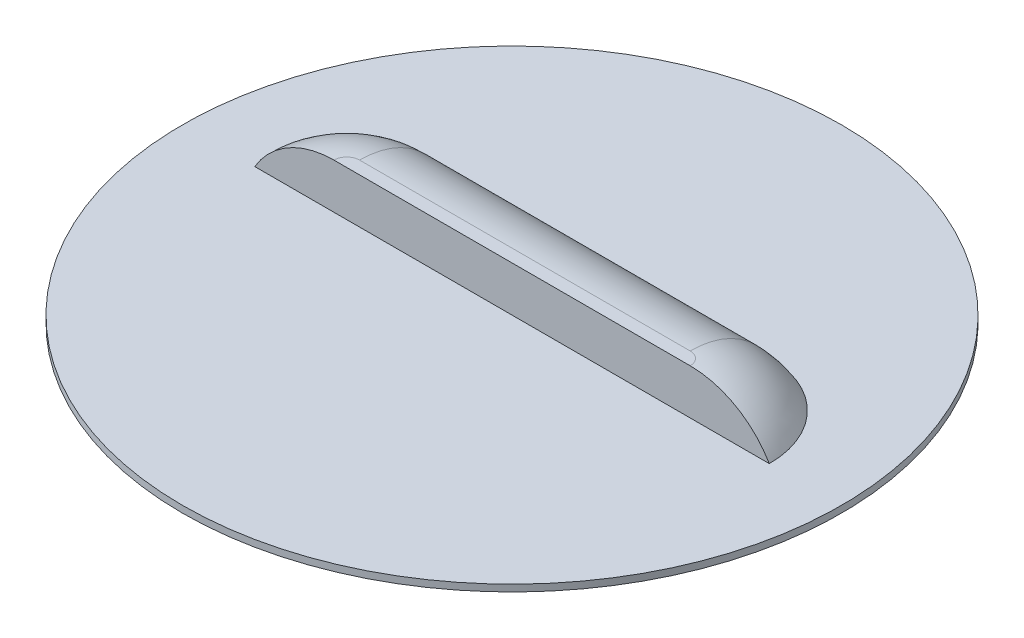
ISO-10303-21;
HEADER;
FILE_DESCRIPTION(('STEP AP214'),'2;1');
FILE_NAME('part.step','',(''),(''),'','','');
FILE_SCHEMA(('AUTOMOTIVE_DESIGN { 1 0 10303 214 1 1 1 1 }'));
ENDSEC;
DATA;
#1=APPLICATION_CONTEXT('core data for automotive mechanical design processes');
#2=APPLICATION_PROTOCOL_DEFINITION('international standard','automotive_design',2000,#1);
#3=PRODUCT_CONTEXT('',#1,'mechanical');
#4=PRODUCT('Part','Part','',(#3));
#5=PRODUCT_RELATED_PRODUCT_CATEGORY('part','',(#4));
#6=PRODUCT_DEFINITION_FORMATION('','',#4);
#7=PRODUCT_DEFINITION_CONTEXT('part definition',#1,'design');
#8=PRODUCT_DEFINITION('design','',#6,#7);
#9=PRODUCT_DEFINITION_SHAPE('','',#8);
#10=(LENGTH_UNIT() NAMED_UNIT(*) SI_UNIT(.MILLI.,.METRE.));
#11=(NAMED_UNIT(*) PLANE_ANGLE_UNIT() SI_UNIT($,.RADIAN.));
#12=(NAMED_UNIT(*) SI_UNIT($,.STERADIAN.) SOLID_ANGLE_UNIT());
#13=UNCERTAINTY_MEASURE_WITH_UNIT(LENGTH_MEASURE(1.E-05),#10,'distance_accuracy_value','');
#14=(GEOMETRIC_REPRESENTATION_CONTEXT(3) GLOBAL_UNCERTAINTY_ASSIGNED_CONTEXT((#13)) GLOBAL_UNIT_ASSIGNED_CONTEXT((#10,
#11,#12)) REPRESENTATION_CONTEXT('',''));
#15=CARTESIAN_POINT('',(0.,0.,0.));
#16=DIRECTION('',(0.,0.,1.));
#17=DIRECTION('',(1.,0.,0.));
#18=AXIS2_PLACEMENT_3D('',#15,#16,#17);
#19=CARTESIAN_POINT('',(0.,0.9144,0.));
#20=DIRECTION('',(0.,1.,0.));
#21=DIRECTION('',(0.,0.,1.));
#22=AXIS2_PLACEMENT_3D('',#19,#20,#21);
#23=PLANE('',#22);
#24=CARTESIAN_POINT('',(0.,0.9144,0.));
#25=DIRECTION('',(0.,1.,0.));
#26=DIRECTION('',(0.,0.,1.));
#27=AXIS2_PLACEMENT_3D('',#24,#25,#26);
#28=CIRCLE('',#27,44.45);
#29=CARTESIAN_POINT('',(0.,0.9144,44.45));
#30=VERTEX_POINT('',#29);
#31=EDGE_CURVE('E107',#30,#30,#28,.T.);
#32=ORIENTED_EDGE('',*,*,#31,.T.);
#33=EDGE_LOOP('',(#32));
#34=FACE_BOUND('',#33,.T.);
#35=DIRECTION('',(1.,0.,0.));
#36=VECTOR('',#35,1.);
#37=CARTESIAN_POINT('',(-34.696404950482,0.9144,0.));
#38=LINE('',#37,#36);
#39=CARTESIAN_POINT('',(-34.696404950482,0.9144,0.));
#40=VERTEX_POINT('',#39);
#41=CARTESIAN_POINT('',(34.7074880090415,0.9144,0.));
#42=VERTEX_POINT('',#41);
#43=EDGE_CURVE('E85',#40,#42,#38,.T.);
#44=ORIENTED_EDGE('',*,*,#43,.F.);
#45=CARTESIAN_POINT('',(-22.2901169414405,0.9144,0.));
#46=DIRECTION('',(0.,1.,0.));
#47=DIRECTION('',(0.,0.,1.));
#48=AXIS2_PLACEMENT_3D('',#45,#46,#47);
#49=CIRCLE('',#48,12.4062880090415);
#50=CARTESIAN_POINT('',(-22.2901169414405,0.9144,-12.4062880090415));
#51=VERTEX_POINT('',#50);
#52=EDGE_CURVE('E94',#51,#40,#49,.T.);
#53=ORIENTED_EDGE('',*,*,#52,.F.);
#54=DIRECTION('',(-1.,0.,0.));
#55=VECTOR('',#54,1.);
#56=CARTESIAN_POINT('',(-22.2901169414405,0.9144,-12.4062880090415));
#57=LINE('',#56,#55);
#58=CARTESIAN_POINT('',(22.3012,0.9144,-12.4062880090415));
#59=VERTEX_POINT('',#58);
#60=EDGE_CURVE('E105',#59,#51,#57,.T.);
#61=ORIENTED_EDGE('',*,*,#60,.F.);
#62=CARTESIAN_POINT('',(22.3012,0.9144,0.));
#63=DIRECTION('',(0.,1.,0.));
#64=DIRECTION('',(0.,0.,-1.));
#65=AXIS2_PLACEMENT_3D('',#62,#63,#64);
#66=CIRCLE('',#65,12.4062880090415);
#67=EDGE_CURVE('E96',#42,#59,#66,.T.);
#68=ORIENTED_EDGE('',*,*,#67,.F.);
#69=EDGE_LOOP('',(#44,#53,#61,#68));
#70=FACE_BOUND('',#69,.T.);
#71=ADVANCED_FACE('F39',(#34,#70),#23,.T.);
#72=CARTESIAN_POINT('',(0.,0.9144,0.));
#73=DIRECTION('',(0.,-1.,0.));
#74=DIRECTION('',(0.,0.,-1.));
#75=AXIS2_PLACEMENT_3D('',#72,#73,#74);
#76=CYLINDRICAL_SURFACE('',#75,44.45);
#77=ORIENTED_EDGE('',*,*,#31,.F.);
#78=EDGE_LOOP('',(#77));
#79=FACE_BOUND('',#78,.T.);
#80=CARTESIAN_POINT('',(0.,0.,0.));
#81=DIRECTION('',(0.,1.,0.));
#82=DIRECTION('',(0.,0.,1.));
#83=AXIS2_PLACEMENT_3D('',#80,#81,#82);
#84=CIRCLE('',#83,44.45);
#85=CARTESIAN_POINT('',(0.,0.,44.45));
#86=VERTEX_POINT('',#85);
#87=EDGE_CURVE('E111',#86,#86,#84,.T.);
#88=ORIENTED_EDGE('',*,*,#87,.T.);
#89=EDGE_LOOP('',(#88));
#90=FACE_BOUND('',#89,.T.);
#91=ADVANCED_FACE('F127',(#79,#90),#76,.T.);
#92=CARTESIAN_POINT('',(0.,0.,0.));
#93=DIRECTION('',(0.,1.,0.));
#94=DIRECTION('',(0.,0.,1.));
#95=AXIS2_PLACEMENT_3D('',#92,#93,#94);
#96=PLANE('',#95);
#97=ORIENTED_EDGE('',*,*,#87,.F.);
#98=EDGE_LOOP('',(#97));
#99=FACE_BOUND('',#98,.T.);
#100=ADVANCED_FACE('F133',(#99),#96,.F.);
#101=CARTESIAN_POINT('',(-34.696404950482,7.0104,0.));
#102=DIRECTION('',(0.,0.,-1.));
#103=DIRECTION('',(-1.,0.,0.));
#104=AXIS2_PLACEMENT_3D('',#101,#102,#103);
#105=PLANE('',#104);
#106=ORIENTED_EDGE('',*,*,#43,.T.);
#107=CARTESIAN_POINT('',(24.0322333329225,-5.3848,0.));
#108=DIRECTION('',(0.,0.,-1.));
#109=DIRECTION('',(-1.,0.,0.));
#110=AXIS2_PLACEMENT_3D('',#107,#108,#109);
#111=CIRCLE('',#110,12.3952);
#112=CARTESIAN_POINT('',(24.0322333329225,7.0104,0.));
#113=VERTEX_POINT('',#112);
#114=EDGE_CURVE('E11',#42,#113,#111,.F.);
#115=ORIENTED_EDGE('',*,*,#114,.T.);
#116=DIRECTION('',(1.,0.,0.));
#117=VECTOR('',#116,1.);
#118=CARTESIAN_POINT('',(-34.696404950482,7.0104,0.));
#119=LINE('',#118,#117);
#120=CARTESIAN_POINT('',(-24.0211502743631,7.0104,0.));
#121=VERTEX_POINT('',#120);
#122=EDGE_CURVE('E88',#121,#113,#119,.T.);
#123=ORIENTED_EDGE('',*,*,#122,.F.);
#124=CARTESIAN_POINT('',(-24.0211502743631,-5.3848,0.));
#125=DIRECTION('',(0.,0.,-1.));
#126=DIRECTION('',(-1.,0.,0.));
#127=AXIS2_PLACEMENT_3D('',#124,#125,#126);
#128=CIRCLE('',#127,12.3952);
#129=EDGE_CURVE('E48',#121,#40,#128,.F.);
#130=ORIENTED_EDGE('',*,*,#129,.T.);
#131=EDGE_LOOP('',(#106,#115,#123,#130));
#132=FACE_BOUND('',#131,.T.);
#133=ADVANCED_FACE('F84',(#132),#105,.F.);
#134=CARTESIAN_POINT('',(-22.2901169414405,7.0104,0.));
#135=DIRECTION('',(0.,1.,0.));
#136=DIRECTION('',(0.,0.,1.));
#137=AXIS2_PLACEMENT_3D('',#134,#135,#136);
#138=PLANE('',#137);
#139=ORIENTED_EDGE('',*,*,#122,.T.);
#140=CARTESIAN_POINT('',(22.3012,7.0104,0.));
#141=DIRECTION('',(0.,1.,0.));
#142=DIRECTION('',(0.,0.,1.));
#143=AXIS2_PLACEMENT_3D('',#140,#141,#142);
#144=CIRCLE('',#143,1.73103333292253);
#145=CARTESIAN_POINT('',(22.3012,7.0104,-1.73103333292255));
#146=VERTEX_POINT('',#145);
#147=EDGE_CURVE('E91',#113,#146,#144,.T.);
#148=ORIENTED_EDGE('',*,*,#147,.T.);
#149=DIRECTION('',(1.,0.,0.));
#150=VECTOR('',#149,1.);
#151=CARTESIAN_POINT('',(-22.2901169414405,7.0104,-1.73103333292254));
#152=LINE('',#151,#150);
#153=CARTESIAN_POINT('',(-22.2901169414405,7.0104,-1.73103333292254));
#154=VERTEX_POINT('',#153);
#155=EDGE_CURVE('E63',#146,#154,#152,.F.);
#156=ORIENTED_EDGE('',*,*,#155,.T.);
#157=CARTESIAN_POINT('',(-22.2901169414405,7.0104,0.));
#158=DIRECTION('',(0.,1.,0.));
#159=DIRECTION('',(0.,0.,1.));
#160=AXIS2_PLACEMENT_3D('',#157,#158,#159);
#161=CIRCLE('',#160,1.73103333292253);
#162=EDGE_CURVE('E110',#154,#121,#161,.T.);
#163=ORIENTED_EDGE('',*,*,#162,.T.);
#164=EDGE_LOOP('',(#139,#148,#156,#163));
#165=FACE_BOUND('',#164,.T.);
#166=ADVANCED_FACE('F116',(#165),#138,.T.);
#167=CARTESIAN_POINT('',(-22.2901169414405,-5.3848,0.));
#168=DIRECTION('',(0.,-1.,0.));
#169=DIRECTION('',(0.,0.,-1.));
#170=AXIS2_PLACEMENT_3D('',#167,#168,#169);
#171=DEGENERATE_TOROIDAL_SURFACE('',#170,1.73103333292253,12.3952,.T.);
#172=ORIENTED_EDGE('',*,*,#129,.F.);
#173=ORIENTED_EDGE('',*,*,#162,.F.);
#174=CARTESIAN_POINT('',(-22.2901169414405,-5.3848,-1.73103333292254));
#175=DIRECTION('',(1.,0.,0.));
#176=DIRECTION('',(0.,0.,-1.));
#177=AXIS2_PLACEMENT_3D('',#174,#175,#176);
#178=CIRCLE('',#177,12.3952);
#179=EDGE_CURVE('E43',#51,#154,#178,.T.);
#180=ORIENTED_EDGE('',*,*,#179,.F.);
#181=ORIENTED_EDGE('',*,*,#52,.T.);
#182=EDGE_LOOP('',(#172,#173,#180,#181));
#183=FACE_BOUND('',#182,.T.);
#184=ADVANCED_FACE('F41',(#183),#171,.T.);
#185=CARTESIAN_POINT('',(-22.2901169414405,-5.3848,-1.73103333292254));
#186=DIRECTION('',(-1.,0.,0.));
#187=DIRECTION('',(0.,0.,1.));
#188=AXIS2_PLACEMENT_3D('',#185,#186,#187);
#189=CYLINDRICAL_SURFACE('',#188,12.3952);
#190=ORIENTED_EDGE('',*,*,#179,.T.);
#191=ORIENTED_EDGE('',*,*,#155,.F.);
#192=CARTESIAN_POINT('',(22.3012,-5.3848,-1.73103333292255));
#193=DIRECTION('',(1.,0.,0.));
#194=DIRECTION('',(0.,0.,-1.));
#195=AXIS2_PLACEMENT_3D('',#192,#193,#194);
#196=CIRCLE('',#195,12.3952);
#197=EDGE_CURVE('E56',#59,#146,#196,.T.);
#198=ORIENTED_EDGE('',*,*,#197,.F.);
#199=ORIENTED_EDGE('',*,*,#60,.T.);
#200=EDGE_LOOP('',(#190,#191,#198,#199));
#201=FACE_BOUND('',#200,.T.);
#202=ADVANCED_FACE('F119',(#201),#189,.T.);
#203=CARTESIAN_POINT('',(22.3012,-5.3848,0.));
#204=DIRECTION('',(0.,-1.,0.));
#205=DIRECTION('',(0.,0.,-1.));
#206=AXIS2_PLACEMENT_3D('',#203,#204,#205);
#207=DEGENERATE_TOROIDAL_SURFACE('',#206,1.73103333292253,12.3952,.T.);
#208=ORIENTED_EDGE('',*,*,#114,.F.);
#209=ORIENTED_EDGE('',*,*,#67,.T.);
#210=ORIENTED_EDGE('',*,*,#197,.T.);
#211=ORIENTED_EDGE('',*,*,#147,.F.);
#212=EDGE_LOOP('',(#208,#209,#210,#211));
#213=FACE_BOUND('',#212,.T.);
#214=ADVANCED_FACE('F117',(#213),#207,.T.);
#215=CLOSED_SHELL('',(#71,#91,#100,#133,#166,#184,#202,#214));
#216=MANIFOLD_SOLID_BREP('B2',#215);
#217=ADVANCED_BREP_SHAPE_REPRESENTATION('',(#18,#216),#14);
#218=SHAPE_DEFINITION_REPRESENTATION(#9,#217);
ENDSEC;
END-ISO-10303-21;
